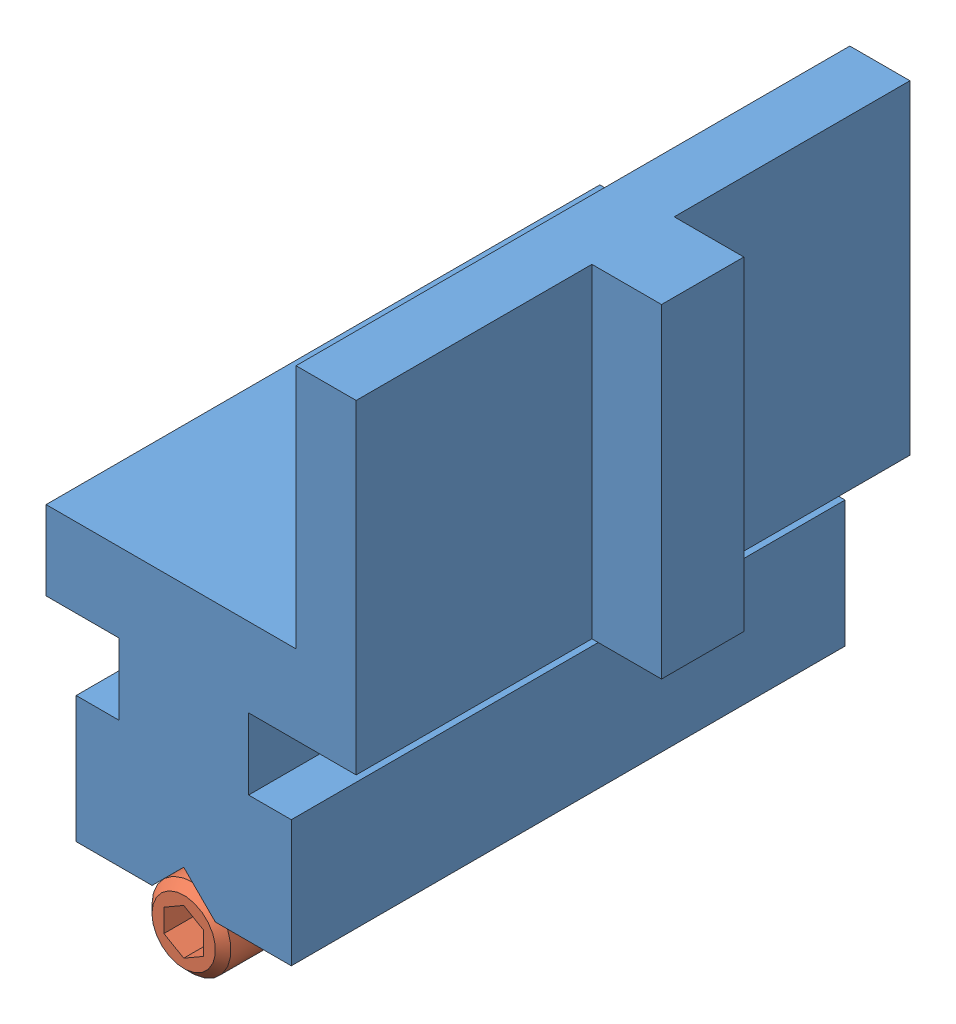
SolidWorks assembly 22.1079 GUIDE FOR SLIDING DOOR.SLDASM, configuration Default (file format 3800). Lengths in mm.
Overall size (24 37.04 35).
3 component instances, 2 part files, 6 mates.
Components (placement in the parent):
- 22.1079 GUIDE FOR SLIDING DOOR SLIDE BAR-1: 22.1079 GUIDE FOR SLIDING DOOR SLIDE BAR.SLDPRT [Default] at origin size (24 33 35)
- SET SCREW M5X10 POINTED END DIN 914-1: SET SCREW M5X10 POINTED END DIN 914.SLDPRT [Default] at (0 -14.0355 7.5) x (0 0 1) z (-1 0 0) size (10 5 5)
- SET SCREW M5X10 POINTED END DIN 914-2: SET SCREW M5X10 POINTED END DIN 914.SLDPRT [Default] at (0 -14.0355 -7.5) x (0 0 -1) z (1 0 0) size (10 5 5)
Mates (geometry in assembly coordinates):
- Coincident1: coincident: plane of 22.1079 GUIDE FOR SLIDING DOOR SLIDE BAR-1 through (0 0 0) normal (0 1 0); plane of ? through (0 -15.4438 7.5) normal (-1 0 0)
- Coincident2: coincident: plane of 22.1079 GUIDE FOR SLIDING DOOR SLIDE BAR-1 through (4.3157 2.5385 17.5) normal (0 0 1); plane of ? through (0 -15.4438 17.5) normal (0 0 1)
- Tangent1: tangent anti-aligned: plane of 22.1079 GUIDE FOR SLIDING DOOR SLIDE BAR-1 through (0 -10.5 17.5) normal (0.707107 -0.707107 0); cylinder of ?
- Coincident3: coincident: plane of 22.1079 GUIDE FOR SLIDING DOOR SLIDE BAR-1 through (0 0 0) normal (0 1 0); plane of ? through (0 18.8736 -7.5) normal (1 0 0)
- Coincident4: coincident: plane of 22.1079 GUIDE FOR SLIDING DOOR SLIDE BAR-1 through (4.3157 2.5385 -17.5) normal (0 0 -1); plane of ? through (0 18.8736 -17.5) normal (0 0 -1)
- Tangent2: tangent anti-aligned: cylinder of ?; plane of 22.1079 GUIDE FOR SLIDING DOOR SLIDE BAR-1 through (0 -10.5 17.5) normal (0.707107 -0.707107 0)
